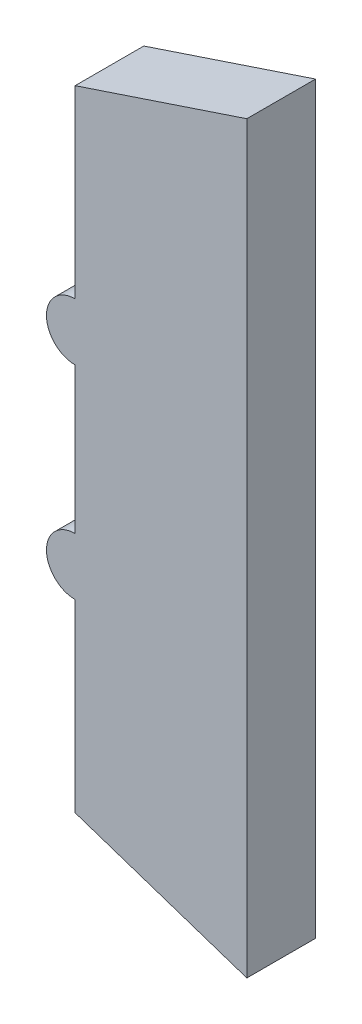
ISO-10303-21;
HEADER;
FILE_DESCRIPTION(('STEP AP214'),'2;1');
FILE_NAME('part.step','',(''),(''),'','','');
FILE_SCHEMA(('AUTOMOTIVE_DESIGN { 1 0 10303 214 1 1 1 1 }'));
ENDSEC;
DATA;
#1=APPLICATION_CONTEXT('core data for automotive mechanical design processes');
#2=APPLICATION_PROTOCOL_DEFINITION('international standard','automotive_design',2000,#1);
#3=PRODUCT_CONTEXT('',#1,'mechanical');
#4=PRODUCT('Part','Part','',(#3));
#5=PRODUCT_RELATED_PRODUCT_CATEGORY('part','',(#4));
#6=PRODUCT_DEFINITION_FORMATION('','',#4);
#7=PRODUCT_DEFINITION_CONTEXT('part definition',#1,'design');
#8=PRODUCT_DEFINITION('design','',#6,#7);
#9=PRODUCT_DEFINITION_SHAPE('','',#8);
#10=(LENGTH_UNIT() NAMED_UNIT(*) SI_UNIT(.MILLI.,.METRE.));
#11=(NAMED_UNIT(*) PLANE_ANGLE_UNIT() SI_UNIT($,.RADIAN.));
#12=(NAMED_UNIT(*) SI_UNIT($,.STERADIAN.) SOLID_ANGLE_UNIT());
#13=UNCERTAINTY_MEASURE_WITH_UNIT(LENGTH_MEASURE(1.E-05),#10,'distance_accuracy_value','');
#14=(GEOMETRIC_REPRESENTATION_CONTEXT(3) GLOBAL_UNCERTAINTY_ASSIGNED_CONTEXT((#13)) GLOBAL_UNIT_ASSIGNED_CONTEXT((#10,
#11,#12)) REPRESENTATION_CONTEXT('',''));
#15=CARTESIAN_POINT('',(0.,0.,0.));
#16=DIRECTION('',(0.,0.,1.));
#17=DIRECTION('',(1.,0.,0.));
#18=AXIS2_PLACEMENT_3D('',#15,#16,#17);
#19=CARTESIAN_POINT('',(0.,0.,0.6));
#20=DIRECTION('',(0.,0.,1.));
#21=DIRECTION('',(1.,0.,0.));
#22=AXIS2_PLACEMENT_3D('',#19,#20,#21);
#23=PLANE('',#22);
#24=DIRECTION('',(0.948683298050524,-0.316227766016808,0.));
#25=VECTOR('',#24,1.);
#26=CARTESIAN_POINT('',(-1.5,-5.5,0.6));
#27=LINE('',#26,#25);
#28=CARTESIAN_POINT('',(1.50000000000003,-6.4999999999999,0.6));
#29=VERTEX_POINT('',#28);
#30=CARTESIAN_POINT('',(-1.5,-5.5,0.6));
#31=VERTEX_POINT('',#30);
#32=EDGE_CURVE('E125',#29,#31,#27,.F.);
#33=ORIENTED_EDGE('',*,*,#32,.F.);
#34=DIRECTION('',(0.,1.,0.));
#35=VECTOR('',#34,1.);
#36=CARTESIAN_POINT('',(1.5,-6.5,0.6));
#37=LINE('',#36,#35);
#38=CARTESIAN_POINT('',(1.5,6.5,0.6));
#39=VERTEX_POINT('',#38);
#40=EDGE_CURVE('E130',#39,#29,#37,.F.);
#41=ORIENTED_EDGE('',*,*,#40,.F.);
#42=DIRECTION('',(-0.948683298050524,-0.316227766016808,0.));
#43=VECTOR('',#42,1.);
#44=CARTESIAN_POINT('',(1.5,6.5,0.6));
#45=LINE('',#44,#43);
#46=CARTESIAN_POINT('',(-1.50000000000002,5.50000000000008,0.6));
#47=VERTEX_POINT('',#46);
#48=EDGE_CURVE('E94',#47,#39,#45,.F.);
#49=ORIENTED_EDGE('',*,*,#48,.F.);
#50=DIRECTION('',(0.,1.,0.));
#51=VECTOR('',#50,1.);
#52=CARTESIAN_POINT('',(-1.5,5.5,0.6));
#53=LINE('',#52,#51);
#54=CARTESIAN_POINT('',(-1.5,2.275,0.6));
#55=VERTEX_POINT('',#54);
#56=EDGE_CURVE('E90',#55,#47,#53,.T.);
#57=ORIENTED_EDGE('',*,*,#56,.F.);
#58=CARTESIAN_POINT('',(-1.5,1.775,0.6));
#59=DIRECTION('',(0.,0.,1.));
#60=DIRECTION('',(1.,0.,0.));
#61=AXIS2_PLACEMENT_3D('',#58,#59,#60);
#62=CIRCLE('',#61,0.5);
#63=CARTESIAN_POINT('',(-1.5,1.275,0.6));
#64=VERTEX_POINT('',#63);
#65=EDGE_CURVE('E19',#64,#55,#62,.F.);
#66=ORIENTED_EDGE('',*,*,#65,.F.);
#67=DIRECTION('',(0.,1.,0.));
#68=VECTOR('',#67,1.);
#69=CARTESIAN_POINT('',(-1.5,1.275,0.6));
#70=LINE('',#69,#68);
#71=CARTESIAN_POINT('',(-1.5,-1.275,0.6));
#72=VERTEX_POINT('',#71);
#73=EDGE_CURVE('E77',#72,#64,#70,.T.);
#74=ORIENTED_EDGE('',*,*,#73,.F.);
#75=CARTESIAN_POINT('',(-1.5,-1.775,0.6));
#76=DIRECTION('',(0.,0.,1.));
#77=DIRECTION('',(1.,0.,0.));
#78=AXIS2_PLACEMENT_3D('',#75,#76,#77);
#79=CIRCLE('',#78,0.5);
#80=CARTESIAN_POINT('',(-1.5,-2.275,0.6));
#81=VERTEX_POINT('',#80);
#82=EDGE_CURVE('E143',#81,#72,#79,.F.);
#83=ORIENTED_EDGE('',*,*,#82,.F.);
#84=DIRECTION('',(0.,1.,0.));
#85=VECTOR('',#84,1.);
#86=CARTESIAN_POINT('',(-1.5,-2.275,0.6));
#87=LINE('',#86,#85);
#88=EDGE_CURVE('E119',#31,#81,#87,.T.);
#89=ORIENTED_EDGE('',*,*,#88,.F.);
#90=EDGE_LOOP('',(#33,#41,#49,#57,#66,#74,#83,#89));
#91=FACE_BOUND('',#90,.T.);
#92=ADVANCED_FACE('F16',(#91),#23,.T.);
#93=CARTESIAN_POINT('',(-1.5,5.5,-0.6));
#94=DIRECTION('',(-1.,0.,0.));
#95=DIRECTION('',(0.,0.,1.));
#96=AXIS2_PLACEMENT_3D('',#93,#94,#95);
#97=PLANE('',#96);
#98=ORIENTED_EDGE('',*,*,#56,.T.);
#99=DIRECTION('',(0.,0.,1.));
#100=VECTOR('',#99,1.);
#101=CARTESIAN_POINT('',(-1.50000000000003,5.5000000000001,-0.6));
#102=LINE('',#101,#100);
#103=CARTESIAN_POINT('',(-1.50000000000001,5.50000000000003,-0.6));
#104=VERTEX_POINT('',#103);
#105=EDGE_CURVE('E107',#104,#47,#102,.T.);
#106=ORIENTED_EDGE('',*,*,#105,.F.);
#107=DIRECTION('',(0.,1.,0.));
#108=VECTOR('',#107,1.);
#109=CARTESIAN_POINT('',(-1.5,0.,-0.6));
#110=LINE('',#109,#108);
#111=CARTESIAN_POINT('',(-1.5,2.275,-0.6));
#112=VERTEX_POINT('',#111);
#113=EDGE_CURVE('E101',#104,#112,#110,.F.);
#114=ORIENTED_EDGE('',*,*,#113,.T.);
#115=DIRECTION('',(0.,0.,1.));
#116=VECTOR('',#115,1.);
#117=CARTESIAN_POINT('',(-1.5,2.275,-0.6));
#118=LINE('',#117,#116);
#119=EDGE_CURVE('E86',#55,#112,#118,.F.);
#120=ORIENTED_EDGE('',*,*,#119,.F.);
#121=EDGE_LOOP('',(#98,#106,#114,#120));
#122=FACE_BOUND('',#121,.T.);
#123=ADVANCED_FACE('F100',(#122),#97,.T.);
#124=CARTESIAN_POINT('',(-1.5,1.775,-0.6));
#125=DIRECTION('',(0.,0.,1.));
#126=DIRECTION('',(1.,0.,0.));
#127=AXIS2_PLACEMENT_3D('',#124,#125,#126);
#128=CYLINDRICAL_SURFACE('',#127,0.5);
#129=ORIENTED_EDGE('',*,*,#65,.T.);
#130=ORIENTED_EDGE('',*,*,#119,.T.);
#131=CARTESIAN_POINT('',(-1.5,1.775,-0.6));
#132=DIRECTION('',(0.,0.,1.));
#133=DIRECTION('',(1.,0.,0.));
#134=AXIS2_PLACEMENT_3D('',#131,#132,#133);
#135=CIRCLE('',#134,0.5);
#136=CARTESIAN_POINT('',(-1.5,1.275,-0.6));
#137=VERTEX_POINT('',#136);
#138=EDGE_CURVE('E142',#112,#137,#135,.T.);
#139=ORIENTED_EDGE('',*,*,#138,.T.);
#140=DIRECTION('',(0.,0.,1.));
#141=VECTOR('',#140,1.);
#142=CARTESIAN_POINT('',(-1.5,1.275,-0.6));
#143=LINE('',#142,#141);
#144=EDGE_CURVE('E88',#64,#137,#143,.F.);
#145=ORIENTED_EDGE('',*,*,#144,.F.);
#146=EDGE_LOOP('',(#129,#130,#139,#145));
#147=FACE_BOUND('',#146,.T.);
#148=ADVANCED_FACE('F83',(#147),#128,.T.);
#149=CARTESIAN_POINT('',(-1.5,1.275,-0.6));
#150=DIRECTION('',(-1.,0.,0.));
#151=DIRECTION('',(0.,0.,1.));
#152=AXIS2_PLACEMENT_3D('',#149,#150,#151);
#153=PLANE('',#152);
#154=ORIENTED_EDGE('',*,*,#73,.T.);
#155=ORIENTED_EDGE('',*,*,#144,.T.);
#156=DIRECTION('',(0.,1.,0.));
#157=VECTOR('',#156,1.);
#158=CARTESIAN_POINT('',(-1.5,0.,-0.6));
#159=LINE('',#158,#157);
#160=CARTESIAN_POINT('',(-1.5,-1.275,-0.6));
#161=VERTEX_POINT('',#160);
#162=EDGE_CURVE('E141',#137,#161,#159,.F.);
#163=ORIENTED_EDGE('',*,*,#162,.T.);
#164=DIRECTION('',(0.,0.,1.));
#165=VECTOR('',#164,1.);
#166=CARTESIAN_POINT('',(-1.5,-1.275,-0.6));
#167=LINE('',#166,#165);
#168=EDGE_CURVE('E122',#72,#161,#167,.F.);
#169=ORIENTED_EDGE('',*,*,#168,.F.);
#170=EDGE_LOOP('',(#154,#155,#163,#169));
#171=FACE_BOUND('',#170,.T.);
#172=ADVANCED_FACE('F149',(#171),#153,.T.);
#173=CARTESIAN_POINT('',(-1.5,-1.775,-0.6));
#174=DIRECTION('',(0.,0.,1.));
#175=DIRECTION('',(1.,0.,0.));
#176=AXIS2_PLACEMENT_3D('',#173,#174,#175);
#177=CYLINDRICAL_SURFACE('',#176,0.5);
#178=ORIENTED_EDGE('',*,*,#82,.T.);
#179=ORIENTED_EDGE('',*,*,#168,.T.);
#180=CARTESIAN_POINT('',(-1.5,-1.775,-0.6));
#181=DIRECTION('',(0.,0.,1.));
#182=DIRECTION('',(1.,0.,0.));
#183=AXIS2_PLACEMENT_3D('',#180,#181,#182);
#184=CIRCLE('',#183,0.5);
#185=CARTESIAN_POINT('',(-1.5,-2.275,-0.6));
#186=VERTEX_POINT('',#185);
#187=EDGE_CURVE('E137',#161,#186,#184,.T.);
#188=ORIENTED_EDGE('',*,*,#187,.T.);
#189=DIRECTION('',(0.,0.,1.));
#190=VECTOR('',#189,1.);
#191=CARTESIAN_POINT('',(-1.5,-2.275,-0.6));
#192=LINE('',#191,#190);
#193=EDGE_CURVE('E121',#81,#186,#192,.F.);
#194=ORIENTED_EDGE('',*,*,#193,.F.);
#195=EDGE_LOOP('',(#178,#179,#188,#194));
#196=FACE_BOUND('',#195,.T.);
#197=ADVANCED_FACE('F185',(#196),#177,.T.);
#198=CARTESIAN_POINT('',(-1.5,-2.275,-0.6));
#199=DIRECTION('',(-1.,0.,0.));
#200=DIRECTION('',(0.,0.,1.));
#201=AXIS2_PLACEMENT_3D('',#198,#199,#200);
#202=PLANE('',#201);
#203=ORIENTED_EDGE('',*,*,#88,.T.);
#204=ORIENTED_EDGE('',*,*,#193,.T.);
#205=DIRECTION('',(0.,1.,0.));
#206=VECTOR('',#205,1.);
#207=CARTESIAN_POINT('',(-1.5,0.,-0.6));
#208=LINE('',#207,#206);
#209=CARTESIAN_POINT('',(-1.5,-5.5,-0.6));
#210=VERTEX_POINT('',#209);
#211=EDGE_CURVE('E140',#186,#210,#208,.F.);
#212=ORIENTED_EDGE('',*,*,#211,.T.);
#213=DIRECTION('',(0.,0.,1.));
#214=VECTOR('',#213,1.);
#215=CARTESIAN_POINT('',(-1.5,-5.5,-0.6));
#216=LINE('',#215,#214);
#217=EDGE_CURVE('E127',#31,#210,#216,.F.);
#218=ORIENTED_EDGE('',*,*,#217,.F.);
#219=EDGE_LOOP('',(#203,#204,#212,#218));
#220=FACE_BOUND('',#219,.T.);
#221=ADVANCED_FACE('F181',(#220),#202,.T.);
#222=CARTESIAN_POINT('',(-1.5,-5.5,-0.6));
#223=DIRECTION('',(-0.316227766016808,-0.948683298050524,0.));
#224=DIRECTION('',(0.948683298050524,-0.316227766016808,0.));
#225=AXIS2_PLACEMENT_3D('',#222,#223,#224);
#226=PLANE('',#225);
#227=ORIENTED_EDGE('',*,*,#32,.T.);
#228=ORIENTED_EDGE('',*,*,#217,.T.);
#229=DIRECTION('',(0.948683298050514,-0.316227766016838,0.));
#230=VECTOR('',#229,1.);
#231=CARTESIAN_POINT('',(-1.5,-5.5,-0.6));
#232=LINE('',#231,#230);
#233=CARTESIAN_POINT('',(1.50000000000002,-6.49999999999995,-0.6));
#234=VERTEX_POINT('',#233);
#235=EDGE_CURVE('E165',#210,#234,#232,.T.);
#236=ORIENTED_EDGE('',*,*,#235,.T.);
#237=DIRECTION('',(0.,0.,-1.));
#238=VECTOR('',#237,1.);
#239=CARTESIAN_POINT('',(1.5,-6.5,-0.6));
#240=LINE('',#239,#238);
#241=EDGE_CURVE('E109',#29,#234,#240,.T.);
#242=ORIENTED_EDGE('',*,*,#241,.F.);
#243=EDGE_LOOP('',(#227,#228,#236,#242));
#244=FACE_BOUND('',#243,.T.);
#245=ADVANCED_FACE('F175',(#244),#226,.T.);
#246=CARTESIAN_POINT('',(1.5,-6.5,-0.6));
#247=DIRECTION('',(1.,0.,0.));
#248=DIRECTION('',(0.,0.,-1.));
#249=AXIS2_PLACEMENT_3D('',#246,#247,#248);
#250=PLANE('',#249);
#251=ORIENTED_EDGE('',*,*,#40,.T.);
#252=ORIENTED_EDGE('',*,*,#241,.T.);
#253=DIRECTION('',(0.,1.,0.));
#254=VECTOR('',#253,1.);
#255=CARTESIAN_POINT('',(1.5,0.,-0.6));
#256=LINE('',#255,#254);
#257=CARTESIAN_POINT('',(1.5,6.5,-0.6));
#258=VERTEX_POINT('',#257);
#259=EDGE_CURVE('E25',#234,#258,#256,.T.);
#260=ORIENTED_EDGE('',*,*,#259,.T.);
#261=DIRECTION('',(0.,0.,1.));
#262=VECTOR('',#261,1.);
#263=CARTESIAN_POINT('',(1.5,6.5,-0.6));
#264=LINE('',#263,#262);
#265=EDGE_CURVE('E33',#39,#258,#264,.F.);
#266=ORIENTED_EDGE('',*,*,#265,.F.);
#267=EDGE_LOOP('',(#251,#252,#260,#266));
#268=FACE_BOUND('',#267,.T.);
#269=ADVANCED_FACE('F184',(#268),#250,.T.);
#270=CARTESIAN_POINT('',(1.5,6.5,-0.6));
#271=DIRECTION('',(-0.316227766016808,0.948683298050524,0.));
#272=DIRECTION('',(-0.948683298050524,-0.316227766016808,0.));
#273=AXIS2_PLACEMENT_3D('',#270,#271,#272);
#274=PLANE('',#273);
#275=ORIENTED_EDGE('',*,*,#48,.T.);
#276=ORIENTED_EDGE('',*,*,#265,.T.);
#277=DIRECTION('',(-0.948683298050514,-0.316227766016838,0.));
#278=VECTOR('',#277,1.);
#279=CARTESIAN_POINT('',(1.5,6.5,-0.6));
#280=LINE('',#279,#278);
#281=EDGE_CURVE('E11',#258,#104,#280,.T.);
#282=ORIENTED_EDGE('',*,*,#281,.T.);
#283=ORIENTED_EDGE('',*,*,#105,.T.);
#284=EDGE_LOOP('',(#275,#276,#282,#283));
#285=FACE_BOUND('',#284,.T.);
#286=ADVANCED_FACE('F196',(#285),#274,.T.);
#287=CARTESIAN_POINT('',(0.,0.,-0.6));
#288=DIRECTION('',(0.,0.,1.));
#289=DIRECTION('',(1.,0.,0.));
#290=AXIS2_PLACEMENT_3D('',#287,#288,#289);
#291=PLANE('',#290);
#292=ORIENTED_EDGE('',*,*,#259,.F.);
#293=ORIENTED_EDGE('',*,*,#235,.F.);
#294=ORIENTED_EDGE('',*,*,#211,.F.);
#295=ORIENTED_EDGE('',*,*,#187,.F.);
#296=ORIENTED_EDGE('',*,*,#162,.F.);
#297=ORIENTED_EDGE('',*,*,#138,.F.);
#298=ORIENTED_EDGE('',*,*,#113,.F.);
#299=ORIENTED_EDGE('',*,*,#281,.F.);
#300=EDGE_LOOP('',(#292,#293,#294,#295,#296,#297,#298,#299));
#301=FACE_BOUND('',#300,.T.);
#302=ADVANCED_FACE('F153',(#301),#291,.F.);
#303=CLOSED_SHELL('',(#92,#123,#148,#172,#197,#221,#245,#269,#286,#302));
#304=MANIFOLD_SOLID_BREP('B1',#303);
#305=ADVANCED_BREP_SHAPE_REPRESENTATION('',(#18,#304),#14);
#306=SHAPE_DEFINITION_REPRESENTATION(#9,#305);
ENDSEC;
END-ISO-10303-21;
